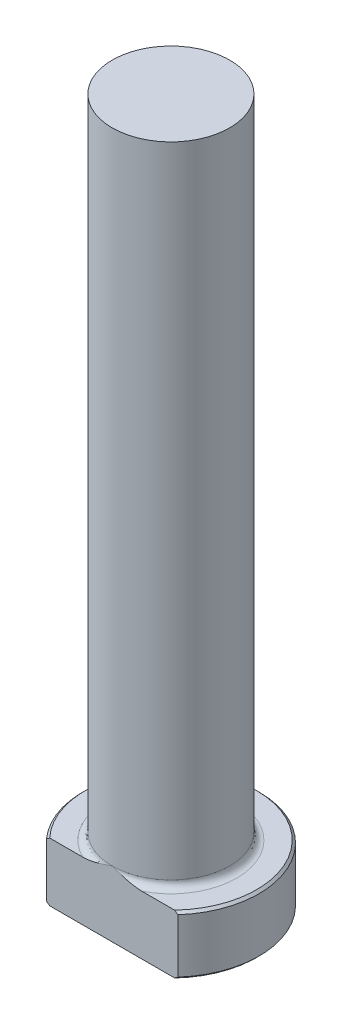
ISO-10303-21;
HEADER;
FILE_DESCRIPTION(('STEP AP214'),'2;1');
FILE_NAME('part.step','',(''),(''),'','','');
FILE_SCHEMA(('AUTOMOTIVE_DESIGN { 1 0 10303 214 1 1 1 1 }'));
ENDSEC;
DATA;
#1=APPLICATION_CONTEXT('core data for automotive mechanical design processes');
#2=APPLICATION_PROTOCOL_DEFINITION('international standard','automotive_design',2000,#1);
#3=PRODUCT_CONTEXT('',#1,'mechanical');
#4=PRODUCT('Part','Part','',(#3));
#5=PRODUCT_RELATED_PRODUCT_CATEGORY('part','',(#4));
#6=PRODUCT_DEFINITION_FORMATION('','',#4);
#7=PRODUCT_DEFINITION_CONTEXT('part definition',#1,'design');
#8=PRODUCT_DEFINITION('design','',#6,#7);
#9=PRODUCT_DEFINITION_SHAPE('','',#8);
#10=(LENGTH_UNIT() NAMED_UNIT(*) SI_UNIT(.MILLI.,.METRE.));
#11=(NAMED_UNIT(*) PLANE_ANGLE_UNIT() SI_UNIT($,.RADIAN.));
#12=(NAMED_UNIT(*) SI_UNIT($,.STERADIAN.) SOLID_ANGLE_UNIT());
#13=UNCERTAINTY_MEASURE_WITH_UNIT(LENGTH_MEASURE(1.E-05),#10,'distance_accuracy_value','');
#14=(GEOMETRIC_REPRESENTATION_CONTEXT(3) GLOBAL_UNCERTAINTY_ASSIGNED_CONTEXT((#13)) GLOBAL_UNIT_ASSIGNED_CONTEXT((#10,
#11,#12)) REPRESENTATION_CONTEXT('',''));
#15=CARTESIAN_POINT('',(0.,0.,0.));
#16=DIRECTION('',(0.,0.,1.));
#17=DIRECTION('',(1.,0.,0.));
#18=AXIS2_PLACEMENT_3D('',#15,#16,#17);
#19=CARTESIAN_POINT('',(0.,0.,0.));
#20=DIRECTION('',(0.,-1.,0.));
#21=DIRECTION('',(0.,0.,-1.));
#22=AXIS2_PLACEMENT_3D('',#19,#20,#21);
#23=PLANE('',#22);
#24=CARTESIAN_POINT('',(0.,0.,0.));
#25=DIRECTION('',(0.,-1.,0.));
#26=DIRECTION('',(0.,0.,-1.));
#27=AXIS2_PLACEMENT_3D('',#24,#25,#26);
#28=CIRCLE('',#27,9.27099999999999);
#29=CARTESIAN_POINT('',(-6.7549197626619,0.,6.34999999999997));
#30=VERTEX_POINT('',#29);
#31=CARTESIAN_POINT('',(6.7549197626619,0.,6.34999999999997));
#32=VERTEX_POINT('',#31);
#33=EDGE_CURVE('E98',#30,#32,#28,.T.);
#34=ORIENTED_EDGE('',*,*,#33,.T.);
#35=DIRECTION('',(-1.,0.,0.));
#36=VECTOR('',#35,1.);
#37=CARTESIAN_POINT('',(-7.09951582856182,0.,6.34999999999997));
#38=LINE('',#37,#36);
#39=EDGE_CURVE('E83',#32,#30,#38,.T.);
#40=ORIENTED_EDGE('',*,*,#39,.T.);
#41=EDGE_LOOP('',(#34,#40));
#42=FACE_BOUND('',#41,.T.);
#43=ADVANCED_FACE('F32',(#42),#23,.T.);
#44=CARTESIAN_POINT('',(0.,259.958771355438,0.));
#45=DIRECTION('',(0.,1.,0.));
#46=DIRECTION('',(0.,0.,1.));
#47=AXIS2_PLACEMENT_3D('',#44,#45,#46);
#48=CYLINDRICAL_SURFACE('',#47,9.52499999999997);
#49=CARTESIAN_POINT('',(0.,6.09599999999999,0.));
#50=DIRECTION('',(0.,1.,0.));
#51=DIRECTION('',(0.,0.,1.));
#52=AXIS2_PLACEMENT_3D('',#49,#50,#51);
#53=CIRCLE('',#52,9.52499999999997);
#54=CARTESIAN_POINT('',(-7.09951582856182,6.09599999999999,6.34999999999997));
#55=VERTEX_POINT('',#54);
#56=CARTESIAN_POINT('',(7.09951582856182,6.09599999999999,6.34999999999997));
#57=VERTEX_POINT('',#56);
#58=EDGE_CURVE('E104',#55,#57,#53,.F.);
#59=ORIENTED_EDGE('',*,*,#58,.T.);
#60=DIRECTION('',(0.,-1.,0.));
#61=VECTOR('',#60,1.);
#62=CARTESIAN_POINT('',(7.09951582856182,76.2,6.34999999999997));
#63=LINE('',#62,#61);
#64=CARTESIAN_POINT('',(7.09951582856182,0.253999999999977,6.34999999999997));
#65=VERTEX_POINT('',#64);
#66=EDGE_CURVE('E183',#57,#65,#63,.T.);
#67=ORIENTED_EDGE('',*,*,#66,.T.);
#68=CARTESIAN_POINT('',(0.,0.253999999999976,0.));
#69=DIRECTION('',(0.,-1.,0.));
#70=DIRECTION('',(0.,0.,-1.));
#71=AXIS2_PLACEMENT_3D('',#68,#69,#70);
#72=CIRCLE('',#71,9.52499999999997);
#73=CARTESIAN_POINT('',(-7.09951582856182,0.253999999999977,6.34999999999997));
#74=VERTEX_POINT('',#73);
#75=EDGE_CURVE('E100',#65,#74,#72,.F.);
#76=ORIENTED_EDGE('',*,*,#75,.T.);
#77=DIRECTION('',(0.,-1.,0.));
#78=VECTOR('',#77,1.);
#79=CARTESIAN_POINT('',(-7.09951582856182,76.2,6.34999999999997));
#80=LINE('',#79,#78);
#81=EDGE_CURVE('E93',#55,#74,#80,.T.);
#82=ORIENTED_EDGE('',*,*,#81,.F.);
#83=EDGE_LOOP('',(#59,#67,#76,#82));
#84=FACE_BOUND('',#83,.T.);
#85=ADVANCED_FACE('F158',(#84),#48,.T.);
#86=CARTESIAN_POINT('',(-9.52499999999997,6.35,0.));
#87=DIRECTION('',(0.,1.,0.));
#88=DIRECTION('',(0.,0.,1.));
#89=AXIS2_PLACEMENT_3D('',#86,#87,#88);
#90=PLANE('',#89);
#91=CARTESIAN_POINT('',(0.,6.35,0.));
#92=DIRECTION('',(0.,1.,0.));
#93=DIRECTION('',(0.,0.,1.));
#94=AXIS2_PLACEMENT_3D('',#91,#92,#93);
#95=CIRCLE('',#94,9.27099999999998);
#96=CARTESIAN_POINT('',(6.75491976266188,6.35,6.34999999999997));
#97=VERTEX_POINT('',#96);
#98=CARTESIAN_POINT('',(-6.75491976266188,6.35,6.34999999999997));
#99=VERTEX_POINT('',#98);
#100=EDGE_CURVE('E178',#97,#99,#95,.T.);
#101=ORIENTED_EDGE('',*,*,#100,.T.);
#102=DIRECTION('',(1.,0.,0.));
#103=VECTOR('',#102,1.);
#104=CARTESIAN_POINT('',(-9.52499999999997,6.35,6.34999999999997));
#105=LINE('',#104,#103);
#106=CARTESIAN_POINT('',(-3.20281813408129,6.35000000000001,6.34999999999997));
#107=VERTEX_POINT('',#106);
#108=EDGE_CURVE('E57',#99,#107,#105,.T.);
#109=ORIENTED_EDGE('',*,*,#108,.T.);
#110=CARTESIAN_POINT('',(0.,6.35,0.));
#111=DIRECTION('',(0.,1.,0.));
#112=DIRECTION('',(0.,0.,1.));
#113=AXIS2_PLACEMENT_3D('',#110,#111,#112);
#114=CIRCLE('',#113,7.11199999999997);
#115=CARTESIAN_POINT('',(3.20281813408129,6.35000000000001,6.34999999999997));
#116=VERTEX_POINT('',#115);
#117=EDGE_CURVE('E107',#107,#116,#114,.F.);
#118=ORIENTED_EDGE('',*,*,#117,.T.);
#119=EDGE_CURVE('E136',#116,#97,#105,.T.);
#120=ORIENTED_EDGE('',*,*,#119,.T.);
#121=EDGE_LOOP('',(#101,#109,#118,#120));
#122=FACE_BOUND('',#121,.T.);
#123=ADVANCED_FACE('F147',(#122),#90,.T.);
#124=CARTESIAN_POINT('',(0.,6.35000000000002,0.));
#125=DIRECTION('',(0.,-1.,0.));
#126=DIRECTION('',(0.,0.,-1.));
#127=AXIS2_PLACEMENT_3D('',#124,#125,#126);
#128=CONICAL_SURFACE('',#127,9.27099999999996,0.785398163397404);
#129=ORIENTED_EDGE('',*,*,#58,.F.);
#130=CARTESIAN_POINT('',(-15.620497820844,-1.24086384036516,6.34999999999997));
#131=CARTESIAN_POINT('',(-15.3857047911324,-1.0233600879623,6.34999999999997));
#132=CARTESIAN_POINT('',(-15.1505693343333,-0.806226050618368,6.34999999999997));
#133=CARTESIAN_POINT('',(-14.6795103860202,-0.372811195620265,6.34999999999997));
#134=CARTESIAN_POINT('',(-14.4435868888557,-0.156530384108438,6.34999999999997));
#135=CARTESIAN_POINT('',(-13.7343831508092,0.490949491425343,6.34999999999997));
#136=CARTESIAN_POINT('',(-13.2597703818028,0.920692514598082,6.34999999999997));
#137=CARTESIAN_POINT('',(-12.3030369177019,1.77753207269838,6.34999999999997));
#138=CARTESIAN_POINT('',(-11.8208883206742,2.20459751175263,6.34999999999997));
#139=CARTESIAN_POINT('',(-10.8502816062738,3.05140730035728,6.34999999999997));
#140=CARTESIAN_POINT('',(-10.3618242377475,3.47115250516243,6.34999999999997));
#141=CARTESIAN_POINT('',(-9.47483904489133,4.21707154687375,6.34999999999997));
#142=CARTESIAN_POINT('',(-9.07790966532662,4.54513737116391,6.34999999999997));
#143=CARTESIAN_POINT('',(-8.47677412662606,5.03023560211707,6.34999999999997));
#144=CARTESIAN_POINT('',(-8.27541054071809,5.19078991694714,6.34999999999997));
#145=CARTESIAN_POINT('',(-7.87046621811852,5.50907445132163,6.34999999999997));
#146=CARTESIAN_POINT('',(-7.66688552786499,5.66680472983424,6.34999999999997));
#147=CARTESIAN_POINT('',(-7.2573551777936,5.97869148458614,6.34999999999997));
#148=CARTESIAN_POINT('',(-7.05140838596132,6.13285171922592,6.34999999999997));
#149=CARTESIAN_POINT('',(-6.63647957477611,6.43702261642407,6.34999999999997));
#150=CARTESIAN_POINT('',(-6.42749769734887,6.58703347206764,6.34999999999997));
#151=CARTESIAN_POINT('',(-6.00602408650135,6.88188396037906,6.34999999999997));
#152=CARTESIAN_POINT('',(-5.79353372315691,7.02672554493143,6.34999999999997));
#153=CARTESIAN_POINT('',(-5.36434063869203,7.31000426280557,6.34999999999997));
#154=CARTESIAN_POINT('',(-5.14763839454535,7.44844211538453,6.34999999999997));
#155=CARTESIAN_POINT('',(-4.7155223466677,7.71338638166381,6.34999999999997));
#156=CARTESIAN_POINT('',(-4.50024913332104,7.84012086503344,6.34999999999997));
#157=CARTESIAN_POINT('',(-4.06421720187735,8.08391309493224,6.34999999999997));
#158=CARTESIAN_POINT('',(-3.84345787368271,8.20096975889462,6.34999999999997));
#159=CARTESIAN_POINT('',(-3.39588009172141,8.42261670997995,6.34999999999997));
#160=CARTESIAN_POINT('',(-3.16906543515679,8.52721459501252,6.34999999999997));
#161=CARTESIAN_POINT('',(-2.70873812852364,8.72055178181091,6.34999999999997));
#162=CARTESIAN_POINT('',(-2.47522738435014,8.80929554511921,6.34999999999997));
#163=CARTESIAN_POINT('',(-2.05336662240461,8.94953872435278,6.34999999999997));
#164=CARTESIAN_POINT('',(-1.86632074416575,9.00493855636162,6.34999999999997));
#165=CARTESIAN_POINT('',(-1.48854269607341,9.10141876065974,6.34999999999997));
#166=CARTESIAN_POINT('',(-1.29781098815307,9.14250091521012,6.34999999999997));
#167=CARTESIAN_POINT('',(-0.914152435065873,9.20830900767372,6.34999999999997));
#168=CARTESIAN_POINT('',(-0.721234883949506,9.23308834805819,6.34999999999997));
#169=CARTESIAN_POINT('',(-0.333938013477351,9.26515279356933,6.34999999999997));
#170=CARTESIAN_POINT('',(-0.139558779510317,9.27243891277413,6.34999999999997));
#171=CARTESIAN_POINT('',(0.249582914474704,9.26908452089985,6.34999999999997));
#172=CARTESIAN_POINT('',(0.444344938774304,9.25839414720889,6.34999999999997));
#173=CARTESIAN_POINT('',(0.832115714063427,9.21961933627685,6.34999999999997));
#174=CARTESIAN_POINT('',(1.02512432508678,9.19153352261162,6.34999999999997));
#175=CARTESIAN_POINT('',(1.4087062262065,9.11935938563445,6.34999999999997));
#176=CARTESIAN_POINT('',(1.59927002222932,9.07522133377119,6.34999999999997));
#177=CARTESIAN_POINT('',(1.9765677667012,8.972968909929,6.34999999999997));
#178=CARTESIAN_POINT('',(2.16330153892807,8.91485389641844,6.34999999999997));
#179=CARTESIAN_POINT('',(2.55340558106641,8.77956545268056,6.34999999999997));
#180=CARTESIAN_POINT('',(2.75628314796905,8.70098324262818,6.34999999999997));
#181=CARTESIAN_POINT('',(3.15702163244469,8.53183500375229,6.34999999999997));
#182=CARTESIAN_POINT('',(3.35488038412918,8.44126390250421,6.34999999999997));
#183=CARTESIAN_POINT('',(3.74617402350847,8.25030745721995,6.34999999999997));
#184=CARTESIAN_POINT('',(3.93960103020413,8.14990608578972,6.34999999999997));
#185=CARTESIAN_POINT('',(4.32214375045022,7.94130427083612,6.34999999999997));
#186=CARTESIAN_POINT('',(4.51126000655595,7.8331048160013,6.34999999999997));
#187=CARTESIAN_POINT('',(4.88806427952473,7.60898083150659,6.34999999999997));
#188=CARTESIAN_POINT('',(5.07570450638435,7.49297632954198,6.34999999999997));
#189=CARTESIAN_POINT('',(5.44760916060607,7.25568772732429,6.34999999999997));
#190=CARTESIAN_POINT('',(5.63187351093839,7.13440350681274,6.34999999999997));
#191=CARTESIAN_POINT('',(5.9972907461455,6.88762375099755,6.34999999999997));
#192=CARTESIAN_POINT('',(6.17844648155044,6.76213242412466,6.34999999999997));
#193=CARTESIAN_POINT('',(6.53821557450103,6.50756961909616,6.34999999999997));
#194=CARTESIAN_POINT('',(6.71682895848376,6.37849817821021,6.34999999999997));
#195=CARTESIAN_POINT('',(7.093023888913,6.10179008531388,6.34999999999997));
#196=CARTESIAN_POINT('',(7.2903268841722,5.95377527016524,6.34999999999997));
#197=CARTESIAN_POINT('',(7.68256835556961,5.65464146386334,6.34999999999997));
#198=CARTESIAN_POINT('',(7.87750676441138,5.50352238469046,6.34999999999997));
#199=CARTESIAN_POINT('',(8.45932112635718,5.04627326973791,6.34999999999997));
#200=CARTESIAN_POINT('',(8.84315989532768,4.73627837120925,6.34999999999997));
#201=CARTESIAN_POINT('',(9.60509700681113,4.10866416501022,6.34999999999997));
#202=CARTESIAN_POINT('',(9.9831898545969,3.7910382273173,6.34999999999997));
#203=CARTESIAN_POINT('',(10.7347161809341,3.15031094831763,6.34999999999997));
#204=CARTESIAN_POINT('',(11.1081495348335,2.82720946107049,6.34999999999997));
#205=CARTESIAN_POINT('',(11.8301543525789,2.1954146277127,6.34999999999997));
#206=CARTESIAN_POINT('',(12.178928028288,1.88695183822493,6.34999999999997));
#207=CARTESIAN_POINT('',(12.8738739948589,1.26709898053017,6.34999999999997));
#208=CARTESIAN_POINT('',(13.2200462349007,0.955708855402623,6.34999999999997));
#209=CARTESIAN_POINT('',(13.9095994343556,0.331196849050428,6.34999999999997));
#210=CARTESIAN_POINT('',(14.2529845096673,0.0180795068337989,6.34999999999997));
#211=CARTESIAN_POINT('',(14.9379801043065,-0.610061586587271,6.34999999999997));
#212=CARTESIAN_POINT('',(15.2795906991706,-0.925085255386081,6.34999999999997));
#213=CARTESIAN_POINT('',(15.620497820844,-1.24086384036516,6.34999999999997));
#214=B_SPLINE_CURVE_WITH_KNOTS('',3,(#130,#131,#132,#133,#134,#135,#136,#137,#138,#139,#140,
#141,#142,#143,#144,#145,#146,#147,#148,#149,#150,#151,#152,#153,#154,#155,#156,#157,#158,#159,
#160,#161,#162,#163,#164,#165,#166,#167,#168,#169,#170,#171,#172,#173,#174,#175,#176,#177,#178,
#179,#180,#181,#182,#183,#184,#185,#186,#187,#188,#189,#190,#191,#192,#193,#194,#195,#196,#197,
#198,#199,#200,#201,#202,#203,#204,#205,#206,#207,#208,#209,#210,#211,#212,#213),.UNSPECIFIED.,
.F.,.F.,(4,2,2,2,2,2,2,2,2,2,2,2,2,2,2,2,2,2,2,2,2,2,2,2,2,2,2,2,2,2,2,2,2,2,2,2,2,2,2,2,2,4),
(0.,0.960166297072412,1.92033949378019,3.84109812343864,5.773318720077,7.70531203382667,
9.25006454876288,10.0226538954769,10.795227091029,11.5669461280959,12.3386291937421,
13.1100177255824,13.8813194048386,14.6305489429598,15.3798621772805,16.1287160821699,
16.8773589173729,17.4621154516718,18.0467991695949,18.6295579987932,19.2122830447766,
19.7966271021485,20.3810174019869,20.9672337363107,21.5534769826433,22.2056947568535,
22.8581893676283,23.5117661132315,24.165260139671,24.8269639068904,25.4886827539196,
26.1497583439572,26.8108270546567,27.5507428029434,28.2906795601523,29.7706888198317,
31.2520340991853,32.7334189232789,34.1302286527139,35.5270655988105,36.9211891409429,
38.3152528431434),.UNSPECIFIED.);
#215=EDGE_CURVE('E135',#55,#99,#214,.T.);
#216=ORIENTED_EDGE('',*,*,#215,.T.);
#217=ORIENTED_EDGE('',*,*,#100,.F.);
#218=EDGE_CURVE('E127',#97,#57,#214,.T.);
#219=ORIENTED_EDGE('',*,*,#218,.T.);
#220=EDGE_LOOP('',(#129,#216,#217,#219));
#221=FACE_BOUND('',#220,.T.);
#222=ADVANCED_FACE('F143',(#221),#128,.T.);
#223=CARTESIAN_POINT('',(0.,0.253999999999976,0.));
#224=DIRECTION('',(0.,1.,0.));
#225=DIRECTION('',(0.,0.,1.));
#226=AXIS2_PLACEMENT_3D('',#223,#224,#225);
#227=CONICAL_SURFACE('',#226,9.52499999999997,0.785398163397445);
#228=ORIENTED_EDGE('',*,*,#75,.F.);
#229=CARTESIAN_POINT('',(15.620497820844,7.59086384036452,6.34999999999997));
#230=CARTESIAN_POINT('',(15.3857047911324,7.37336008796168,6.34999999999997));
#231=CARTESIAN_POINT('',(15.1505693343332,7.15622605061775,6.34999999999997));
#232=CARTESIAN_POINT('',(14.6795103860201,6.72281119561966,6.34999999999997));
#233=CARTESIAN_POINT('',(14.4435868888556,6.50653038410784,6.34999999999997));
#234=CARTESIAN_POINT('',(13.7343831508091,5.85905050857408,6.34999999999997));
#235=CARTESIAN_POINT('',(13.2597703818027,5.42930748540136,6.34999999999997));
#236=CARTESIAN_POINT('',(12.3030369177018,4.57246792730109,6.34999999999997));
#237=CARTESIAN_POINT('',(11.820888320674,4.14540248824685,6.34999999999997));
#238=CARTESIAN_POINT('',(10.8502816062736,3.29859269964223,6.34999999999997));
#239=CARTESIAN_POINT('',(10.3618242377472,2.8788474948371,6.34999999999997));
#240=CARTESIAN_POINT('',(9.47483904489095,2.13292845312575,6.34999999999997));
#241=CARTESIAN_POINT('',(9.07790966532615,1.80486262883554,6.34999999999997));
#242=CARTESIAN_POINT('',(8.47677412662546,1.31976439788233,6.34999999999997));
#243=CARTESIAN_POINT('',(8.27541054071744,1.15921008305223,6.34999999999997));
#244=CARTESIAN_POINT('',(7.87046621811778,0.840925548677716,6.34999999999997));
#245=CARTESIAN_POINT('',(7.6668855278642,0.683195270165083,6.34999999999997));
#246=CARTESIAN_POINT('',(7.25735517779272,0.37130851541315,6.34999999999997));
#247=CARTESIAN_POINT('',(7.05140838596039,0.217148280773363,6.34999999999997));
#248=CARTESIAN_POINT('',(6.63647957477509,-0.0870226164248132,6.34999999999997));
#249=CARTESIAN_POINT('',(6.4274976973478,-0.2370334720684,6.34999999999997));
#250=CARTESIAN_POINT('',(6.00602408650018,-0.531883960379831,6.34999999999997));
#251=CARTESIAN_POINT('',(5.79353372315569,-0.676725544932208,6.34999999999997));
#252=CARTESIAN_POINT('',(5.36434063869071,-0.960004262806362,6.34999999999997));
#253=CARTESIAN_POINT('',(5.14763839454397,-1.09844211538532,6.34999999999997));
#254=CARTESIAN_POINT('',(4.71552234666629,-1.36338638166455,6.34999999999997));
#255=CARTESIAN_POINT('',(4.50024913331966,-1.49012086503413,6.34999999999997));
#256=CARTESIAN_POINT('',(4.06421720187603,-1.73391309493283,6.34999999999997));
#257=CARTESIAN_POINT('',(3.84345787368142,-1.85096975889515,6.34999999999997));
#258=CARTESIAN_POINT('',(3.39588009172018,-2.07261670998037,6.34999999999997));
#259=CARTESIAN_POINT('',(3.16906543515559,-2.17721459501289,6.34999999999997));
#260=CARTESIAN_POINT('',(2.70873812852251,-2.37055178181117,6.34999999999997));
#261=CARTESIAN_POINT('',(2.47522738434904,-2.45929554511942,6.34999999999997));
#262=CARTESIAN_POINT('',(2.05336662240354,-2.5995387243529,6.34999999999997));
#263=CARTESIAN_POINT('',(1.86632074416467,-2.65493855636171,6.34999999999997));
#264=CARTESIAN_POINT('',(1.48854269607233,-2.75141876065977,6.34999999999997));
#265=CARTESIAN_POINT('',(1.29781098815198,-2.79250091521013,6.34999999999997));
#266=CARTESIAN_POINT('',(0.914152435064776,-2.85830900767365,6.34999999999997));
#267=CARTESIAN_POINT('',(0.721234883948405,-2.88308834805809,6.34999999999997));
#268=CARTESIAN_POINT('',(0.333938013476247,-2.91515279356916,6.34999999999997));
#269=CARTESIAN_POINT('',(0.139558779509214,-2.92243891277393,6.34999999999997));
#270=CARTESIAN_POINT('',(-0.249582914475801,-2.91908452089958,6.34999999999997));
#271=CARTESIAN_POINT('',(-0.444344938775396,-2.90839414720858,6.34999999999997));
#272=CARTESIAN_POINT('',(-0.832115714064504,-2.86961933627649,6.34999999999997));
#273=CARTESIAN_POINT('',(-1.02512432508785,-2.84153352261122,6.34999999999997));
#274=CARTESIAN_POINT('',(-1.40870622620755,-2.76935938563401,6.34999999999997));
#275=CARTESIAN_POINT('',(-1.59927002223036,-2.72522133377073,6.34999999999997));
#276=CARTESIAN_POINT('',(-1.97656776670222,-2.6229689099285,6.34999999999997));
#277=CARTESIAN_POINT('',(-2.16330153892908,-2.56485389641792,6.34999999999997));
#278=CARTESIAN_POINT('',(-2.55340558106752,-2.42956545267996,6.34999999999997));
#279=CARTESIAN_POINT('',(-2.75628314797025,-2.35098324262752,6.34999999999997));
#280=CARTESIAN_POINT('',(-3.15702163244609,-2.1818350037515,6.34999999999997));
#281=CARTESIAN_POINT('',(-3.35488038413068,-2.09126390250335,6.34999999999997));
#282=CARTESIAN_POINT('',(-3.74617402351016,-1.90030745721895,6.34999999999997));
#283=CARTESIAN_POINT('',(-3.93960103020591,-1.79990608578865,6.34999999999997));
#284=CARTESIAN_POINT('',(-4.32214375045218,-1.5913042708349,6.34999999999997));
#285=CARTESIAN_POINT('',(-4.511260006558,-1.48310481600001,6.34999999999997));
#286=CARTESIAN_POINT('',(-4.88806427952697,-1.25898083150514,6.34999999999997));
#287=CARTESIAN_POINT('',(-5.07570450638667,-1.14297632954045,6.34999999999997));
#288=CARTESIAN_POINT('',(-5.44760916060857,-0.905687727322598,6.34999999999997));
#289=CARTESIAN_POINT('',(-5.63187351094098,-0.784403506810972,6.34999999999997));
#290=CARTESIAN_POINT('',(-5.99729074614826,-0.537623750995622,6.34999999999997));
#291=CARTESIAN_POINT('',(-6.17844648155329,-0.412132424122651,6.34999999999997));
#292=CARTESIAN_POINT('',(-6.53821557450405,-0.157569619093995,6.34999999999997));
#293=CARTESIAN_POINT('',(-6.71682895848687,-0.0284981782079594,6.34999999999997));
#294=CARTESIAN_POINT('',(-7.0930238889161,0.248209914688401,6.34999999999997));
#295=CARTESIAN_POINT('',(-7.29032688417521,0.396224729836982,6.34999999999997));
#296=CARTESIAN_POINT('',(-7.68256835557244,0.695358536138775,6.34999999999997));
#297=CARTESIAN_POINT('',(-7.87750676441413,0.846477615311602,6.34999999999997));
#298=CARTESIAN_POINT('',(-8.45932112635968,1.30372673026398,6.34999999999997));
#299=CARTESIAN_POINT('',(-8.84315989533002,1.6137216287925,6.34999999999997));
#300=CARTESIAN_POINT('',(-9.60509700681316,2.24133583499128,6.34999999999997));
#301=CARTESIAN_POINT('',(-9.98318985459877,2.55896177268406,6.34999999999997));
#302=CARTESIAN_POINT('',(-10.7347161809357,3.19968905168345,6.34999999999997));
#303=CARTESIAN_POINT('',(-11.1081495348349,3.52279053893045,6.34999999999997));
#304=CARTESIAN_POINT('',(-11.8301543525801,4.15458537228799,6.34999999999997));
#305=CARTESIAN_POINT('',(-12.178928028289,4.46304816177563,6.34999999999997));
#306=CARTESIAN_POINT('',(-12.8738739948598,5.08290101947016,6.34999999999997));
#307=CARTESIAN_POINT('',(-13.2200462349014,5.39429114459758,6.34999999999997));
#308=CARTESIAN_POINT('',(-13.9095994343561,6.01880315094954,6.34999999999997));
#309=CARTESIAN_POINT('',(-14.2529845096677,6.33192049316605,6.34999999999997));
#310=CARTESIAN_POINT('',(-14.9379801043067,6.96006158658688,6.34999999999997));
#311=CARTESIAN_POINT('',(-15.2795906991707,7.27508525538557,6.34999999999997));
#312=CARTESIAN_POINT('',(-15.620497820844,7.59086384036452,6.34999999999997));
#313=B_SPLINE_CURVE_WITH_KNOTS('',3,(#229,#230,#231,#232,#233,#234,#235,#236,#237,#238,#239,
#240,#241,#242,#243,#244,#245,#246,#247,#248,#249,#250,#251,#252,#253,#254,#255,#256,#257,#258,
#259,#260,#261,#262,#263,#264,#265,#266,#267,#268,#269,#270,#271,#272,#273,#274,#275,#276,#277,
#278,#279,#280,#281,#282,#283,#284,#285,#286,#287,#288,#289,#290,#291,#292,#293,#294,#295,#296,
#297,#298,#299,#300,#301,#302,#303,#304,#305,#306,#307,#308,#309,#310,#311,#312),.UNSPECIFIED.,
.F.,.F.,(4,2,2,2,2,2,2,2,2,2,2,2,2,2,2,2,2,2,2,2,2,2,2,2,2,2,2,2,2,2,2,2,2,2,2,2,2,2,2,2,2,4),
(0.,0.960166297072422,1.92033949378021,3.84109812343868,5.77331872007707,7.70531203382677,
9.25006454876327,10.0226538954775,10.7952270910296,11.5669461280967,12.338629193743,
13.1100177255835,13.8813194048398,14.6305489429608,15.3798621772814,16.1287160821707,
16.8773589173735,17.4621154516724,18.0467991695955,18.6295579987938,19.2122830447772,
19.7966271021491,20.3810174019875,20.9672337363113,21.5534769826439,22.2056947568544,
22.8581893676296,23.5117661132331,24.1652601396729,24.8269639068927,25.4886827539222,
26.1497583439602,26.81082705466,27.5507428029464,28.290679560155,29.7706888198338,
31.2520340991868,32.7334189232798,34.1302286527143,35.5270655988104,36.9211891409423,
38.3152528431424),.UNSPECIFIED.);
#314=EDGE_CURVE('E86',#65,#32,#313,.T.);
#315=ORIENTED_EDGE('',*,*,#314,.T.);
#316=ORIENTED_EDGE('',*,*,#33,.F.);
#317=EDGE_CURVE('E89',#30,#74,#313,.T.);
#318=ORIENTED_EDGE('',*,*,#317,.T.);
#319=EDGE_LOOP('',(#228,#315,#316,#318));
#320=FACE_BOUND('',#319,.T.);
#321=ADVANCED_FACE('F97',(#320),#227,.T.);
#322=CARTESIAN_POINT('',(0.,7.11200000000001,0.));
#323=DIRECTION('',(0.,1.,0.));
#324=DIRECTION('',(0.,0.,1.));
#325=AXIS2_PLACEMENT_3D('',#322,#323,#324);
#326=TOROIDAL_SURFACE('',#325,7.11199999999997,0.762);
#327=CARTESIAN_POINT('',(0.,7.11200000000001,6.34999999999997));
#328=CARTESIAN_POINT('',(-1.98730332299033E-11,7.11200099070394,6.34999999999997));
#329=CARTESIAN_POINT('',(2.54281773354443E-07,7.11200198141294,6.34999999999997));
#330=CARTESIAN_POINT('',(1.0280306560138E-06,7.11200387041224,6.34999999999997));
#331=CARTESIAN_POINT('',(1.55832945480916E-06,7.11200476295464,6.34999999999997));
#332=CARTESIAN_POINT('',(2.82630076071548E-06,7.11200655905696,6.34999999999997));
#333=CARTESIAN_POINT('',(3.5815916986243E-06,7.11200745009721,6.34999999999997));
#334=CARTESIAN_POINT('',(5.19075123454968E-06,7.11200910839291,6.34999999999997));
#335=CARTESIAN_POINT('',(6.0431182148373E-06,7.11200987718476,6.34999999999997));
#336=CARTESIAN_POINT('',(9.16920499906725E-06,7.11201253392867,6.34999999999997));
#337=CARTESIAN_POINT('',(1.15677962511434E-05,7.11201427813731,6.34999999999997));
#338=CARTESIAN_POINT('',(1.64593528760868E-05,7.11201731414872,6.34999999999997));
#339=CARTESIAN_POINT('',(1.89415872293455E-05,7.11201862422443,6.34999999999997));
#340=CARTESIAN_POINT('',(2.88859728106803E-05,7.11202372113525,6.34999999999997));
#341=CARTESIAN_POINT('',(3.64752267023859E-05,7.11202727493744,6.34999999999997));
#342=CARTESIAN_POINT('',(5.12411228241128E-05,7.11203291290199,6.34999999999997));
#343=CARTESIAN_POINT('',(5.83739462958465E-05,7.11203511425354,6.34999999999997));
#344=CARTESIAN_POINT('',(8.94436376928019E-05,7.11204475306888,6.34999999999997));
#345=CARTESIAN_POINT('',(0.000113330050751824,7.11205229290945,6.34999999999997));
#346=CARTESIAN_POINT('',(0.000157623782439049,7.11206410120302,6.34999999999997));
#347=CARTESIAN_POINT('',(0.000177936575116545,7.11206870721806,6.34999999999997));
#348=CARTESIAN_POINT('',(0.000328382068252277,7.11210592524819,6.34999999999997));
#349=CARTESIAN_POINT('',(0.00045394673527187,7.1121544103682,6.34999999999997));
#350=CARTESIAN_POINT('',(0.000946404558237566,7.11233771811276,6.34999999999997));
#351=CARTESIAN_POINT('',(0.00131646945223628,7.11246069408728,6.34999999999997));
#352=CARTESIAN_POINT('',(0.00276809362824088,7.11295007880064,6.34999999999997));
#353=CARTESIAN_POINT('',(0.00384642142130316,7.11332889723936,6.34999999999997));
#354=CARTESIAN_POINT('',(0.0083006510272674,7.11488653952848,6.34999999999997));
#355=CARTESIAN_POINT('',(0.0116800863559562,7.1160514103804,6.34999999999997));
#356=CARTESIAN_POINT('',(0.0812880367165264,7.14005423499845,6.34999999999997));
#357=CARTESIAN_POINT('',(0.147476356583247,7.1630529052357,6.34999999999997));
#358=CARTESIAN_POINT('',(0.27735683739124,7.20792044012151,6.34999999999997));
#359=CARTESIAN_POINT('',(0.341046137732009,7.22979850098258,6.34999999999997));
#360=CARTESIAN_POINT('',(0.476297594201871,7.27596846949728,6.34999999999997));
#361=CARTESIAN_POINT('',(0.547870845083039,7.30022868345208,6.34999999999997));
#362=CARTESIAN_POINT('',(0.691958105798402,7.34848126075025,6.34999999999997));
#363=CARTESIAN_POINT('',(0.764473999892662,7.37246799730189,6.34999999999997));
#364=CARTESIAN_POINT('',(0.889840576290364,7.4132466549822,6.34999999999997));
#365=CARTESIAN_POINT('',(0.942635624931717,7.43020921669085,6.34999999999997));
#366=CARTESIAN_POINT('',(1.04823844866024,7.46363183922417,6.34999999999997));
#367=CARTESIAN_POINT('',(1.10104585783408,7.48009305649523,6.34999999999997));
#368=CARTESIAN_POINT('',(1.25725277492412,7.5279153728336,6.34999999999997));
#369=CARTESIAN_POINT('',(1.360886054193,7.55851914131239,6.34999999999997));
#370=CARTESIAN_POINT('',(1.59088732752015,7.62320257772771,6.34999999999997));
#371=CARTESIAN_POINT('',(1.71743494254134,7.65665155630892,6.34999999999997));
#372=CARTESIAN_POINT('',(1.97280417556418,7.71848782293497,6.34999999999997));
#373=CARTESIAN_POINT('',(2.10163577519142,7.74683457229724,6.34999999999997));
#374=CARTESIAN_POINT('',(2.3700410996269,7.79828507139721,6.34999999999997));
#375=CARTESIAN_POINT('',(2.50971812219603,7.82086167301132,6.34999999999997));
#376=CARTESIAN_POINT('',(2.79011040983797,7.85525616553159,6.34999999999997));
#377=CARTESIAN_POINT('',(2.93082167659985,7.86710398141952,6.34999999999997));
#378=CARTESIAN_POINT('',(3.14072761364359,7.87407656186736,6.34999999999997));
#379=CARTESIAN_POINT('',(3.20974558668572,7.87465175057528,6.34999999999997));
#380=CARTESIAN_POINT('',(3.34768897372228,7.87178528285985,6.34999999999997));
#381=CARTESIAN_POINT('',(3.41661441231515,7.86834509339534,6.34999999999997));
#382=CARTESIAN_POINT('',(3.55295435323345,7.856840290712,6.34999999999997));
#383=CARTESIAN_POINT('',(3.62037508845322,7.8488524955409,6.34999999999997));
#384=CARTESIAN_POINT('',(3.75432209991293,7.82745899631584,6.34999999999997));
#385=CARTESIAN_POINT('',(3.82084914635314,7.81405831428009,6.34999999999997));
#386=CARTESIAN_POINT('',(3.94402160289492,7.78281890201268,6.34999999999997));
#387=CARTESIAN_POINT('',(4.00085861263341,7.76574904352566,6.34999999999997));
#388=CARTESIAN_POINT('',(4.11269317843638,7.72554243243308,6.34999999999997));
#389=CARTESIAN_POINT('',(4.16768138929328,7.70237893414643,6.34999999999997));
#390=CARTESIAN_POINT('',(4.274754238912,7.64845340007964,6.34999999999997));
#391=CARTESIAN_POINT('',(4.32679331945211,7.61759890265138,6.34999999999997));
#392=CARTESIAN_POINT('',(4.42436914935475,7.54697047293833,6.34999999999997));
#393=CARTESIAN_POINT('',(4.46994081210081,7.50724766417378,6.34999999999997));
#394=CARTESIAN_POINT('',(4.53046555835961,7.43959446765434,6.34999999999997));
#395=CARTESIAN_POINT('',(4.54952297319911,7.41533971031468,6.34999999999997));
#396=CARTESIAN_POINT('',(4.58379853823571,7.36421578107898,6.34999999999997));
#397=CARTESIAN_POINT('',(4.59901798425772,7.33734749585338,6.34999999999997));
#398=CARTESIAN_POINT('',(4.6247071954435,7.28103780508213,6.34999999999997));
#399=CARTESIAN_POINT('',(4.63512457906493,7.25157201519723,6.34999999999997));
#400=CARTESIAN_POINT('',(4.64995843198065,7.1911663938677,6.34999999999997));
#401=CARTESIAN_POINT('',(4.6543827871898,7.16022855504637,6.34999999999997));
#402=CARTESIAN_POINT('',(4.65660008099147,7.1022078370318,6.34999999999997));
#403=CARTESIAN_POINT('',(4.65518871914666,7.07515315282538,6.34999999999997));
#404=CARTESIAN_POINT('',(4.64761946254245,7.02171954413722,6.34999999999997));
#405=CARTESIAN_POINT('',(4.64146071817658,6.99534074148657,6.34999999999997));
#406=CARTESIAN_POINT('',(4.62523755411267,6.94504159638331,6.34999999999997));
#407=CARTESIAN_POINT('',(4.61534502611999,6.92106470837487,6.34999999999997));
#408=CARTESIAN_POINT('',(4.59226170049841,6.8747751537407,6.34999999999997));
#409=CARTESIAN_POINT('',(4.5790700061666,6.8524629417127,6.34999999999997));
#410=CARTESIAN_POINT('',(4.5418218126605,6.79764783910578,6.34999999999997));
#411=CARTESIAN_POINT('',(4.51582520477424,6.76646268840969,6.34999999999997));
#412=CARTESIAN_POINT('',(4.45923244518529,6.70856515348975,6.34999999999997));
#413=CARTESIAN_POINT('',(4.42862238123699,6.68186683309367,6.34999999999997));
#414=CARTESIAN_POINT('',(4.34541293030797,6.61817721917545,6.34999999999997));
#415=CARTESIAN_POINT('',(4.29043455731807,6.58431535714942,6.34999999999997));
#416=CARTESIAN_POINT('',(4.17622180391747,6.52522207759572,6.34999999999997));
#417=CARTESIAN_POINT('',(4.11698677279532,6.49999198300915,6.34999999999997));
#418=CARTESIAN_POINT('',(4.00208843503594,6.4587014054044,6.34999999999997));
#419=CARTESIAN_POINT('',(3.9466577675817,6.4419775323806,6.34999999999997));
#420=CARTESIAN_POINT('',(3.83455009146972,6.41329756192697,6.34999999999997));
#421=CARTESIAN_POINT('',(3.77787201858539,6.40134571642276,6.34999999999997));
#422=CARTESIAN_POINT('',(3.66308050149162,6.38138585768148,6.34999999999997));
#423=CARTESIAN_POINT('',(3.60495797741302,6.37343127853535,6.34999999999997));
#424=CARTESIAN_POINT('',(3.4883799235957,6.36111790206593,6.34999999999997));
#425=CARTESIAN_POINT('',(3.42992460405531,6.35675704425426,6.34999999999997));
#426=CARTESIAN_POINT('',(3.29509240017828,6.35029195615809,6.34999999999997));
#427=CARTESIAN_POINT('',(3.2186642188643,6.34927526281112,6.34999999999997));
#428=CARTESIAN_POINT('',(3.06586811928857,6.35168618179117,6.34999999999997));
#429=CARTESIAN_POINT('',(2.98950023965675,6.35511565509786,6.34999999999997));
#430=CARTESIAN_POINT('',(2.76031250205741,6.3710761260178,6.34999999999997));
#431=CARTESIAN_POINT('',(2.607884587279,6.38929295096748,6.34999999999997));
#432=CARTESIAN_POINT('',(2.31432643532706,6.43528521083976,6.34999999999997));
#433=CARTESIAN_POINT('',(2.17308394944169,6.46239447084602,6.34999999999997));
#434=CARTESIAN_POINT('',(1.89333619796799,6.52366707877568,6.34999999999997));
#435=CARTESIAN_POINT('',(1.75481809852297,6.55777263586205,6.34999999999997));
#436=CARTESIAN_POINT('',(1.50173407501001,6.62528392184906,6.34999999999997));
#437=CARTESIAN_POINT('',(1.3869516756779,6.65789391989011,6.34999999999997));
#438=CARTESIAN_POINT('',(1.21403608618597,6.70931360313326,6.34999999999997));
#439=CARTESIAN_POINT('',(1.15559330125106,6.72709180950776,6.34999999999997));
#440=CARTESIAN_POINT('',(1.03875270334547,6.76331573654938,6.34999999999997));
#441=CARTESIAN_POINT('',(0.980355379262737,6.78176303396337,6.34999999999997));
#442=CARTESIAN_POINT('',(0.84182633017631,6.82619675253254,6.34999999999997));
#443=CARTESIAN_POINT('',(0.761768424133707,6.85241274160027,6.34999999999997));
#444=CARTESIAN_POINT('',(0.602738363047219,6.90528054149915,6.34999999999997));
#445=CARTESIAN_POINT('',(0.523763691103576,6.93192479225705,6.34999999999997));
#446=CARTESIAN_POINT('',(0.374563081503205,6.98270346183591,6.34999999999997));
#447=CARTESIAN_POINT('',(0.304322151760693,7.00679476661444,6.34999999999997));
#448=CARTESIAN_POINT('',(0.161086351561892,7.05623678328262,6.34999999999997));
#449=CARTESIAN_POINT('',(0.0880951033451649,7.0815989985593,6.34999999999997));
#450=CARTESIAN_POINT('',(0.0116796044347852,7.10794873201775,6.34999999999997));
#451=CARTESIAN_POINT('',(0.00829969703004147,7.10911378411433,6.34999999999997));
#452=CARTESIAN_POINT('',(0.0038453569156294,7.1106714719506,6.34999999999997));
#453=CARTESIAN_POINT('',(0.00276739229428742,7.11105016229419,6.34999999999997));
#454=CARTESIAN_POINT('',(0.0013162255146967,7.11153939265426,6.34999999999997));
#455=CARTESIAN_POINT('',(0.000946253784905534,7.11166233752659,6.34999999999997));
#456=CARTESIAN_POINT('',(0.000453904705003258,7.11184560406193,6.34999999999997));
#457=CARTESIAN_POINT('',(0.000328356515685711,7.11189408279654,6.34999999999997));
#458=CARTESIAN_POINT('',(0.000177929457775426,7.11193129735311,6.34999999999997));
#459=CARTESIAN_POINT('',(0.000157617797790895,7.11193590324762,6.34999999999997));
#460=CARTESIAN_POINT('',(0.000113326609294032,7.11194771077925,6.34999999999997));
#461=CARTESIAN_POINT('',(8.9441576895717E-05,7.11195524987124,6.34999999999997));
#462=CARTESIAN_POINT('',(5.83734289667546E-05,7.1119648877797,6.34999999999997));
#463=CARTESIAN_POINT('',(5.12407709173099E-05,7.11196708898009,6.34999999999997));
#464=CARTESIAN_POINT('',(3.64751950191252E-05,7.11197272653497,6.34999999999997));
#465=CARTESIAN_POINT('',(2.88860890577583E-05,7.11197628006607,6.34999999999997));
#466=CARTESIAN_POINT('',(1.89418472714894E-05,7.11198137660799,6.34999999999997));
#467=CARTESIAN_POINT('',(1.64596255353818E-05,7.11198268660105,6.34999999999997));
#468=CARTESIAN_POINT('',(1.15680783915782E-05,7.11198572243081,6.34999999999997));
#469=CARTESIAN_POINT('',(9.16948288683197E-06,7.11198746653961,6.34999999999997));
#470=CARTESIAN_POINT('',(6.04337167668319E-06,7.11199012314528,6.34999999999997));
#471=CARTESIAN_POINT('',(5.19099381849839E-06,7.11199089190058,6.34999999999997));
#472=CARTESIAN_POINT('',(3.58180595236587E-06,7.11199255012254,6.34999999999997));
#473=CARTESIAN_POINT('',(2.82649744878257E-06,7.11199344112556,6.34999999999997));
#474=CARTESIAN_POINT('',(1.55848394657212E-06,7.1119952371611,6.34999999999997));
#475=CARTESIAN_POINT('',(1.02816162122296E-06,7.11199612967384,6.34999999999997));
#476=CARTESIAN_POINT('',(2.54355049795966E-07,7.11199801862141,6.34999999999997));
#477=CARTESIAN_POINT('',(1.98727903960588E-11,7.11199900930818,6.34999999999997));
#478=CARTESIAN_POINT('',(0.,7.11200000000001,6.34999999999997));
#479=B_SPLINE_CURVE_WITH_KNOTS('',3,(#327,#328,#329,#330,#331,#332,#333,#334,#335,#336,#337,
#338,#339,#340,#341,#342,#343,#344,#345,#346,#347,#348,#349,#350,#351,#352,#353,#354,#355,#356,
#357,#358,#359,#360,#361,#362,#363,#364,#365,#366,#367,#368,#369,#370,#371,#372,#373,#374,#375,
#376,#377,#378,#379,#380,#381,#382,#383,#384,#385,#386,#387,#388,#389,#390,#391,#392,#393,#394,
#395,#396,#397,#398,#399,#400,#401,#402,#403,#404,#405,#406,#407,#408,#409,#410,#411,#412,#413,
#414,#415,#416,#417,#418,#419,#420,#421,#422,#423,#424,#425,#426,#427,#428,#429,#430,#431,#432,
#433,#434,#435,#436,#437,#438,#439,#440,#441,#442,#443,#444,#445,#446,#447,#448,#449,#450,#451,
#452,#453,#454,#455,#456,#457,#458,#459,#460,#461,#462,#463,#464,#465,#466,#467,#468,#469,#470,
#471,#472,#473,#474,#475,#476,#477,#478),.UNSPECIFIED.,.T.,.F.,(4,2,2,2,2,2,2,2,2,2,2,2,2,2,2,2,
2,2,2,2,2,2,2,2,2,2,2,2,2,2,2,2,2,2,2,2,2,2,2,2,2,2,2,2,2,2,2,2,2,2,2,2,2,2,2,2,2,2,2,2,2,2,2,2,
2,2,2,2,2,2,2,2,2,2,2,4),(0.,2.97433544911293E-06,6.07559574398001E-06,9.56379482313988E-06,
1.30039324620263E-05,2.18605341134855E-05,3.02738862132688E-05,5.53487649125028E-05,
7.77184254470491E-05,0.000152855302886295,0.000215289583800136,0.00061784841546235,
0.00178877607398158,0.0052162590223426,0.0159413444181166,0.226133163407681,0.428164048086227,
0.654880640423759,0.884018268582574,1.0503756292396,1.21631462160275,1.54046085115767,
1.93305663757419,2.32864586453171,2.75283206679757,3.17583144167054,3.38280101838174,
3.58969500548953,3.7931936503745,3.99650392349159,4.1742770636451,4.35284387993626,
4.53367075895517,4.71348096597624,4.80574017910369,4.89796820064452,4.99117974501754,
5.08426851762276,5.16511313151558,5.24597221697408,5.32349031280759,5.40102950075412,
5.52213385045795,5.64361099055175,5.83623332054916,6.02888515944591,6.20233104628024,
6.37593113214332,6.55179391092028,6.72755578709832,6.95669586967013,7.18593189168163,
7.64582563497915,8.0770692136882,8.50488455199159,8.86281618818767,9.04607408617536,
9.22979617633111,9.48251462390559,9.73255559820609,9.95533260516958,10.1871278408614,
10.1978544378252,10.2012807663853,10.2024513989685,10.202853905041,10.2029163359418,
10.2029914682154,10.2030138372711,10.203038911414,10.2030473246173,10.203056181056,
10.2030596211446,10.2030631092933,10.2030662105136,10.2030691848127),.UNSPECIFIED.);
#480=CARTESIAN_POINT('',(0.,7.11200000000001,6.34999999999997));
#481=VERTEX_POINT('',#480);
#482=EDGE_CURVE('E11',#116,#481,#479,.T.);
#483=ORIENTED_EDGE('',*,*,#482,.F.);
#484=ORIENTED_EDGE('',*,*,#117,.F.);
#485=CARTESIAN_POINT('',(0.,7.11200000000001,6.34999999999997));
#486=CARTESIAN_POINT('',(1.98732861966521E-11,7.11199900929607,6.34999999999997));
#487=CARTESIAN_POINT('',(-2.54281773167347E-07,7.11199801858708,6.34999999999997));
#488=CARTESIAN_POINT('',(-1.02803065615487E-06,7.11199612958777,6.34999999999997));
#489=CARTESIAN_POINT('',(-1.55832945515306E-06,7.11199523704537,6.34999999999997));
#490=CARTESIAN_POINT('',(-2.82630076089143E-06,7.11199344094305,6.34999999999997));
#491=CARTESIAN_POINT('',(-3.58159169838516E-06,7.1119925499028,6.34999999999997));
#492=CARTESIAN_POINT('',(-5.19075123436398E-06,7.1119908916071,6.34999999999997));
#493=CARTESIAN_POINT('',(-6.04311821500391E-06,7.11199012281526,6.34999999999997));
#494=CARTESIAN_POINT('',(-9.16920500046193E-06,7.11198746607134,6.34999999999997));
#495=CARTESIAN_POINT('',(-1.15677962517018E-05,7.11198572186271,6.34999999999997));
#496=CARTESIAN_POINT('',(-1.6459352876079E-05,7.1119826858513,6.34999999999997));
#497=CARTESIAN_POINT('',(-1.8941587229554E-05,7.11198137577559,6.34999999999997));
#498=CARTESIAN_POINT('',(-2.88859728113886E-05,7.11197627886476,6.34999999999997));
#499=CARTESIAN_POINT('',(-3.6475226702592E-05,7.11197272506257,6.34999999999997));
#500=CARTESIAN_POINT('',(-5.12411228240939E-05,7.11196708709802,6.34999999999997));
#501=CARTESIAN_POINT('',(-5.83739462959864E-05,7.11196488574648,6.34999999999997));
#502=CARTESIAN_POINT('',(-8.94436376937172E-05,7.11195524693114,6.34999999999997));
#503=CARTESIAN_POINT('',(-0.000113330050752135,7.11194770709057,6.34999999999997));
#504=CARTESIAN_POINT('',(-0.000157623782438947,7.111935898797,6.34999999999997));
#505=CARTESIAN_POINT('',(-0.000177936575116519,7.11193129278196,6.34999999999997));
#506=CARTESIAN_POINT('',(-0.000328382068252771,7.11189407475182,6.34999999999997));
#507=CARTESIAN_POINT('',(-0.000453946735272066,7.11184558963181,6.34999999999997));
#508=CARTESIAN_POINT('',(-0.000946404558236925,7.11166228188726,6.34999999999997));
#509=CARTESIAN_POINT('',(-0.00131646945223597,7.11153930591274,6.34999999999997));
#510=CARTESIAN_POINT('',(-0.00276809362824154,7.11104992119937,6.34999999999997));
#511=CARTESIAN_POINT('',(-0.00384642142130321,7.11067110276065,6.34999999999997));
#512=CARTESIAN_POINT('',(-0.00830065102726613,7.10911346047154,6.34999999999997));
#513=CARTESIAN_POINT('',(-0.0116800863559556,7.10794858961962,6.34999999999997));
#514=CARTESIAN_POINT('',(-0.0812880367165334,7.08394576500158,6.34999999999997));
#515=CARTESIAN_POINT('',(-0.147476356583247,7.06094709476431,6.34999999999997));
#516=CARTESIAN_POINT('',(-0.277356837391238,7.01607955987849,6.34999999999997));
#517=CARTESIAN_POINT('',(-0.34104613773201,6.99420149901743,6.34999999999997));
#518=CARTESIAN_POINT('',(-0.476297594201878,6.94803153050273,6.34999999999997));
#519=CARTESIAN_POINT('',(-0.547870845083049,6.92377131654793,6.34999999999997));
#520=CARTESIAN_POINT('',(-0.69195810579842,6.87551873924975,6.34999999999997));
#521=CARTESIAN_POINT('',(-0.764473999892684,6.85153200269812,6.34999999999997));
#522=CARTESIAN_POINT('',(-0.889840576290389,6.81075334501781,6.34999999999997));
#523=CARTESIAN_POINT('',(-0.942635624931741,6.79379078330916,6.34999999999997));
#524=CARTESIAN_POINT('',(-1.04823844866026,6.76036816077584,6.34999999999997));
#525=CARTESIAN_POINT('',(-1.1010458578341,6.74390694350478,6.34999999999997));
#526=CARTESIAN_POINT('',(-1.25725277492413,6.69608462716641,6.34999999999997));
#527=CARTESIAN_POINT('',(-1.36088605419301,6.66548085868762,6.34999999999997));
#528=CARTESIAN_POINT('',(-1.59088732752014,6.60079742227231,6.34999999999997));
#529=CARTESIAN_POINT('',(-1.71743494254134,6.5673484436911,6.34999999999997));
#530=CARTESIAN_POINT('',(-1.97280417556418,6.50551217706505,6.34999999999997));
#531=CARTESIAN_POINT('',(-2.10163577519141,6.47716542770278,6.34999999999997));
#532=CARTESIAN_POINT('',(-2.37004109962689,6.4257149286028,6.34999999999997));
#533=CARTESIAN_POINT('',(-2.50971812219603,6.40313832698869,6.34999999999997));
#534=CARTESIAN_POINT('',(-2.79011040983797,6.36874383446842,6.34999999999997));
#535=CARTESIAN_POINT('',(-2.93082167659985,6.3568960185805,6.34999999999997));
#536=CARTESIAN_POINT('',(-3.14072761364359,6.34992343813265,6.34999999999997));
#537=CARTESIAN_POINT('',(-3.20974558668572,6.34934824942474,6.34999999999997));
#538=CARTESIAN_POINT('',(-3.34768897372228,6.35221471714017,6.34999999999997));
#539=CARTESIAN_POINT('',(-3.41661441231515,6.35565490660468,6.34999999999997));
#540=CARTESIAN_POINT('',(-3.55295435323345,6.36715970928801,6.34999999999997));
#541=CARTESIAN_POINT('',(-3.62037508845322,6.37514750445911,6.34999999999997));
#542=CARTESIAN_POINT('',(-3.75432209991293,6.39654100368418,6.34999999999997));
#543=CARTESIAN_POINT('',(-3.82084914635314,6.40994168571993,6.34999999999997));
#544=CARTESIAN_POINT('',(-3.94402160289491,6.44118109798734,6.34999999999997));
#545=CARTESIAN_POINT('',(-4.0008586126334,6.45825095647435,6.34999999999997));
#546=CARTESIAN_POINT('',(-4.11269317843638,6.49845756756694,6.34999999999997));
#547=CARTESIAN_POINT('',(-4.16768138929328,6.52162106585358,6.34999999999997));
#548=CARTESIAN_POINT('',(-4.274754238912,6.57554659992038,6.34999999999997));
#549=CARTESIAN_POINT('',(-4.32679331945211,6.60640109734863,6.34999999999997));
#550=CARTESIAN_POINT('',(-4.42436914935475,6.67702952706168,6.34999999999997));
#551=CARTESIAN_POINT('',(-4.46994081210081,6.71675233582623,6.34999999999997));
#552=CARTESIAN_POINT('',(-4.53046555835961,6.78440553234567,6.34999999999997));
#553=CARTESIAN_POINT('',(-4.54952297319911,6.80866028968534,6.34999999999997));
#554=CARTESIAN_POINT('',(-4.58379853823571,6.85978421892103,6.34999999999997));
#555=CARTESIAN_POINT('',(-4.59901798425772,6.88665250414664,6.34999999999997));
#556=CARTESIAN_POINT('',(-4.6247071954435,6.94296219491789,6.34999999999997));
#557=CARTESIAN_POINT('',(-4.63512457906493,6.97242798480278,6.34999999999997));
#558=CARTESIAN_POINT('',(-4.64995843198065,7.03283360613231,6.34999999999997));
#559=CARTESIAN_POINT('',(-4.6543827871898,7.06377144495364,6.34999999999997));
#560=CARTESIAN_POINT('',(-4.65660008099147,7.12179216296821,6.34999999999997));
#561=CARTESIAN_POINT('',(-4.65518871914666,7.14884684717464,6.34999999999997));
#562=CARTESIAN_POINT('',(-4.64761946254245,7.20228045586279,6.34999999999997));
#563=CARTESIAN_POINT('',(-4.64146071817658,7.22865925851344,6.34999999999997));
#564=CARTESIAN_POINT('',(-4.62523755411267,7.2789584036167,6.34999999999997));
#565=CARTESIAN_POINT('',(-4.61534502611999,7.30293529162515,6.34999999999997));
#566=CARTESIAN_POINT('',(-4.59226170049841,7.34922484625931,6.34999999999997));
#567=CARTESIAN_POINT('',(-4.5790700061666,7.37153705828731,6.34999999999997));
#568=CARTESIAN_POINT('',(-4.5418218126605,7.42635216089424,6.34999999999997));
#569=CARTESIAN_POINT('',(-4.51582520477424,7.45753731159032,6.34999999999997));
#570=CARTESIAN_POINT('',(-4.4592324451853,7.51543484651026,6.34999999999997));
#571=CARTESIAN_POINT('',(-4.42862238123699,7.54213316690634,6.34999999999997));
#572=CARTESIAN_POINT('',(-4.34541293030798,7.60582278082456,6.34999999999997));
#573=CARTESIAN_POINT('',(-4.29043455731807,7.63968464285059,6.34999999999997));
#574=CARTESIAN_POINT('',(-4.17622180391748,7.69877792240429,6.34999999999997));
#575=CARTESIAN_POINT('',(-4.11698677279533,7.72400801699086,6.34999999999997));
#576=CARTESIAN_POINT('',(-4.00208843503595,7.76529859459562,6.34999999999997));
#577=CARTESIAN_POINT('',(-3.9466577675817,7.78202246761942,6.34999999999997));
#578=CARTESIAN_POINT('',(-3.83455009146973,7.81070243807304,6.34999999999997));
#579=CARTESIAN_POINT('',(-3.7778720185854,7.82265428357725,6.34999999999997));
#580=CARTESIAN_POINT('',(-3.66308050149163,7.84261414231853,6.34999999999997));
#581=CARTESIAN_POINT('',(-3.60495797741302,7.85056872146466,6.34999999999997));
#582=CARTESIAN_POINT('',(-3.48837992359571,7.86288209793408,6.34999999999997));
#583=CARTESIAN_POINT('',(-3.42992460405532,7.86724295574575,6.34999999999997));
#584=CARTESIAN_POINT('',(-3.29509240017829,7.87370804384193,6.34999999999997));
#585=CARTESIAN_POINT('',(-3.21866421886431,7.87472473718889,6.34999999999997));
#586=CARTESIAN_POINT('',(-3.06586811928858,7.87231381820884,6.34999999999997));
#587=CARTESIAN_POINT('',(-2.98950023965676,7.86888434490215,6.34999999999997));
#588=CARTESIAN_POINT('',(-2.76031250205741,7.85292387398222,6.34999999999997));
#589=CARTESIAN_POINT('',(-2.60788458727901,7.83470704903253,6.34999999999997));
#590=CARTESIAN_POINT('',(-2.31432643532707,7.78871478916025,6.34999999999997));
#591=CARTESIAN_POINT('',(-2.1730839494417,7.76160552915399,6.34999999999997));
#592=CARTESIAN_POINT('',(-1.893336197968,7.70033292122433,6.34999999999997));
#593=CARTESIAN_POINT('',(-1.75481809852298,7.66622736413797,6.34999999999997));
#594=CARTESIAN_POINT('',(-1.50173407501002,7.59871607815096,6.34999999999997));
#595=CARTESIAN_POINT('',(-1.38695167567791,7.56610608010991,6.34999999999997));
#596=CARTESIAN_POINT('',(-1.21403608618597,7.51468639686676,6.34999999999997));
#597=CARTESIAN_POINT('',(-1.15559330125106,7.49690819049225,6.34999999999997));
#598=CARTESIAN_POINT('',(-1.03875270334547,7.46068426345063,6.34999999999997));
#599=CARTESIAN_POINT('',(-0.980355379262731,7.44223696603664,6.34999999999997));
#600=CARTESIAN_POINT('',(-0.841826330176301,7.39780324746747,6.34999999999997));
#601=CARTESIAN_POINT('',(-0.761768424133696,7.37158725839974,6.34999999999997));
#602=CARTESIAN_POINT('',(-0.602738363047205,7.31871945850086,6.34999999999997));
#603=CARTESIAN_POINT('',(-0.523763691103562,7.29207520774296,6.34999999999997));
#604=CARTESIAN_POINT('',(-0.374563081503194,7.2412965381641,6.34999999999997));
#605=CARTESIAN_POINT('',(-0.304322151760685,7.21720523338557,6.34999999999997));
#606=CARTESIAN_POINT('',(-0.16108635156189,7.16776321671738,6.34999999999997));
#607=CARTESIAN_POINT('',(-0.0880951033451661,7.14240100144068,6.34999999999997));
#608=CARTESIAN_POINT('',(-0.0116796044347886,7.11605126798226,6.34999999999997));
#609=CARTESIAN_POINT('',(-0.00829969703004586,7.11488621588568,6.34999999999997));
#610=CARTESIAN_POINT('',(-0.0038453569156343,7.1133285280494,6.34999999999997));
#611=CARTESIAN_POINT('',(-0.00276739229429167,7.11294983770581,6.34999999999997));
#612=CARTESIAN_POINT('',(-0.00131622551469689,7.11246060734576,6.34999999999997));
#613=CARTESIAN_POINT('',(-0.000946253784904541,7.11233766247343,6.34999999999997));
#614=CARTESIAN_POINT('',(-0.00045390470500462,7.11215439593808,6.34999999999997));
#615=CARTESIAN_POINT('',(-0.000328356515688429,7.11210591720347,6.34999999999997));
#616=CARTESIAN_POINT('',(-0.00017792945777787,7.1120687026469,6.34999999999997));
#617=CARTESIAN_POINT('',(-0.000157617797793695,7.1120640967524,6.34999999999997));
#618=CARTESIAN_POINT('',(-0.000113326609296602,7.11205228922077,6.34999999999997));
#619=CARTESIAN_POINT('',(-8.9441576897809E-05,7.11204475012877,6.34999999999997));
#620=CARTESIAN_POINT('',(-5.83734289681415E-05,7.11203511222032,6.34999999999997));
#621=CARTESIAN_POINT('',(-5.12407709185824E-05,7.11203291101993,6.34999999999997));
#622=CARTESIAN_POINT('',(-3.64751950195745E-05,7.11202727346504,6.34999999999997));
#623=CARTESIAN_POINT('',(-2.88860890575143E-05,7.11202371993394,6.34999999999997));
#624=CARTESIAN_POINT('',(-1.89418472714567E-05,7.11201862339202,6.34999999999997));
#625=CARTESIAN_POINT('',(-1.64596255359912E-05,7.11201731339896,6.34999999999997));
#626=CARTESIAN_POINT('',(-1.15680783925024E-05,7.1120142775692,6.34999999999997));
#627=CARTESIAN_POINT('',(-9.1694828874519E-06,7.11201253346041,6.34999999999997));
#628=CARTESIAN_POINT('',(-6.04337167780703E-06,7.11200987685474,6.34999999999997));
#629=CARTESIAN_POINT('',(-5.19099381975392E-06,7.11200910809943,6.34999999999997));
#630=CARTESIAN_POINT('',(-3.58180595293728E-06,7.11200744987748,6.34999999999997));
#631=CARTESIAN_POINT('',(-2.82649744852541E-06,7.11200655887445,6.34999999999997));
#632=CARTESIAN_POINT('',(-1.55848394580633E-06,7.11200476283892,6.34999999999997));
#633=CARTESIAN_POINT('',(-1.02816162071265E-06,7.11200387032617,6.34999999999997));
#634=CARTESIAN_POINT('',(-2.54355050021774E-07,7.1120019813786,6.34999999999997));
#635=CARTESIAN_POINT('',(-1.98730433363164E-11,7.11200099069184,6.34999999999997));
#636=CARTESIAN_POINT('',(0.,7.11200000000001,6.34999999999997));
#637=B_SPLINE_CURVE_WITH_KNOTS('',3,(#485,#486,#487,#488,#489,#490,#491,#492,#493,#494,#495,
#496,#497,#498,#499,#500,#501,#502,#503,#504,#505,#506,#507,#508,#509,#510,#511,#512,#513,#514,
#515,#516,#517,#518,#519,#520,#521,#522,#523,#524,#525,#526,#527,#528,#529,#530,#531,#532,#533,
#534,#535,#536,#537,#538,#539,#540,#541,#542,#543,#544,#545,#546,#547,#548,#549,#550,#551,#552,
#553,#554,#555,#556,#557,#558,#559,#560,#561,#562,#563,#564,#565,#566,#567,#568,#569,#570,#571,
#572,#573,#574,#575,#576,#577,#578,#579,#580,#581,#582,#583,#584,#585,#586,#587,#588,#589,#590,
#591,#592,#593,#594,#595,#596,#597,#598,#599,#600,#601,#602,#603,#604,#605,#606,#607,#608,#609,
#610,#611,#612,#613,#614,#615,#616,#617,#618,#619,#620,#621,#622,#623,#624,#625,#626,#627,#628,
#629,#630,#631,#632,#633,#634,#635,#636),.UNSPECIFIED.,.T.,.F.,(4,2,2,2,2,2,2,2,2,2,2,2,2,2,2,2,
2,2,2,2,2,2,2,2,2,2,2,2,2,2,2,2,2,2,2,2,2,2,2,2,2,2,2,2,2,2,2,2,2,2,2,2,2,2,2,2,2,2,2,2,2,2,2,2,
2,2,2,2,2,2,2,2,2,2,2,4),(0.,2.97433544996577E-06,6.07559574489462E-06,9.56379482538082E-06,
1.30039324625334E-05,2.18605341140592E-05,3.02738862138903E-05,5.53487649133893E-05,
7.77184254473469E-05,0.000152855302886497,0.000215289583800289,0.000617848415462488,
0.00178877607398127,0.00521625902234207,0.015941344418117,0.226133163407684,0.428164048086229,
0.654880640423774,0.884018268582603,1.05037562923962,1.21631462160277,1.54046085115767,
1.93305663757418,2.32864586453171,2.75283206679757,3.17583144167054,3.38280101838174,
3.58969500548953,3.7931936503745,3.99650392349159,4.1742770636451,4.35284387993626,
4.53367075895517,4.71348096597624,4.80574017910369,4.89796820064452,4.99117974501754,
5.08426851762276,5.16511313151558,5.24597221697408,5.32349031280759,5.40102950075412,
5.52213385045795,5.64361099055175,5.83623332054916,6.02888515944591,6.20233104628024,
6.37593113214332,6.55179391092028,6.72755578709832,6.95669586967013,7.18593189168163,
7.64582563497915,8.07706921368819,8.50488455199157,8.86281618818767,9.04607408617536,
9.22979617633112,9.4825146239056,9.73255559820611,9.95533260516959,10.1871278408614,
10.1978544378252,10.2012807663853,10.2024513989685,10.202853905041,10.2029163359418,
10.2029914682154,10.2030138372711,10.203038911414,10.2030473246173,10.203056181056,
10.2030596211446,10.2030631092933,10.2030662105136,10.2030691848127),.UNSPECIFIED.);
#638=EDGE_CURVE('E46',#481,#107,#637,.T.);
#639=ORIENTED_EDGE('',*,*,#638,.F.);
#640=CARTESIAN_POINT('',(0.,7.11200000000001,0.));
#641=DIRECTION('',(0.,1.,0.));
#642=DIRECTION('',(0.,0.,1.));
#643=AXIS2_PLACEMENT_3D('',#640,#641,#642);
#644=CIRCLE('',#643,6.34999999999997);
#645=EDGE_CURVE('E103',#481,#481,#644,.T.);
#646=ORIENTED_EDGE('',*,*,#645,.F.);
#647=EDGE_LOOP('',(#483,#484,#639,#646));
#648=FACE_BOUND('',#647,.T.);
#649=ADVANCED_FACE('F34',(#648),#326,.F.);
#650=CARTESIAN_POINT('',(0.,259.958771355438,0.));
#651=DIRECTION('',(0.,1.,0.));
#652=DIRECTION('',(0.,0.,1.));
#653=AXIS2_PLACEMENT_3D('',#650,#651,#652);
#654=CYLINDRICAL_SURFACE('',#653,6.34999999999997);
#655=ORIENTED_EDGE('',*,*,#645,.T.);
#656=EDGE_LOOP('',(#655));
#657=FACE_BOUND('',#656,.T.);
#658=CARTESIAN_POINT('',(0.,76.2,0.));
#659=DIRECTION('',(0.,1.,0.));
#660=DIRECTION('',(0.,0.,1.));
#661=AXIS2_PLACEMENT_3D('',#658,#659,#660);
#662=CIRCLE('',#661,6.34999999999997);
#663=CARTESIAN_POINT('',(0.,76.2,6.34999999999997));
#664=VERTEX_POINT('',#663);
#665=EDGE_CURVE('E101',#664,#664,#662,.T.);
#666=ORIENTED_EDGE('',*,*,#665,.F.);
#667=EDGE_LOOP('',(#666));
#668=FACE_BOUND('',#667,.T.);
#669=ADVANCED_FACE('F155',(#657,#668),#654,.T.);
#670=CARTESIAN_POINT('',(-6.34999999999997,76.2,0.));
#671=DIRECTION('',(0.,1.,0.));
#672=DIRECTION('',(0.,0.,1.));
#673=AXIS2_PLACEMENT_3D('',#670,#671,#672);
#674=PLANE('',#673);
#675=ORIENTED_EDGE('',*,*,#665,.T.);
#676=EDGE_LOOP('',(#675));
#677=FACE_BOUND('',#676,.T.);
#678=ADVANCED_FACE('F121',(#677),#674,.T.);
#679=CARTESIAN_POINT('',(-7.09951582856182,76.2,6.34999999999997));
#680=DIRECTION('',(0.,0.,1.));
#681=DIRECTION('',(1.,0.,0.));
#682=AXIS2_PLACEMENT_3D('',#679,#680,#681);
#683=PLANE('',#682);
#684=ORIENTED_EDGE('',*,*,#66,.F.);
#685=ORIENTED_EDGE('',*,*,#218,.F.);
#686=ORIENTED_EDGE('',*,*,#119,.F.);
#687=ORIENTED_EDGE('',*,*,#482,.T.);
#688=ORIENTED_EDGE('',*,*,#638,.T.);
#689=ORIENTED_EDGE('',*,*,#108,.F.);
#690=ORIENTED_EDGE('',*,*,#215,.F.);
#691=ORIENTED_EDGE('',*,*,#81,.T.);
#692=ORIENTED_EDGE('',*,*,#317,.F.);
#693=ORIENTED_EDGE('',*,*,#39,.F.);
#694=ORIENTED_EDGE('',*,*,#314,.F.);
#695=EDGE_LOOP('',(#684,#685,#686,#687,#688,#689,#690,#691,#692,#693,#694));
#696=FACE_BOUND('',#695,.T.);
#697=ADVANCED_FACE('F85',(#696),#683,.T.);
#698=CLOSED_SHELL('',(#43,#85,#123,#222,#321,#649,#669,#678,#697));
#699=MANIFOLD_SOLID_BREP('B2',#698);
#700=ADVANCED_BREP_SHAPE_REPRESENTATION('',(#18,#699),#14);
#701=SHAPE_DEFINITION_REPRESENTATION(#9,#700);
ENDSEC;
END-ISO-10303-21;
